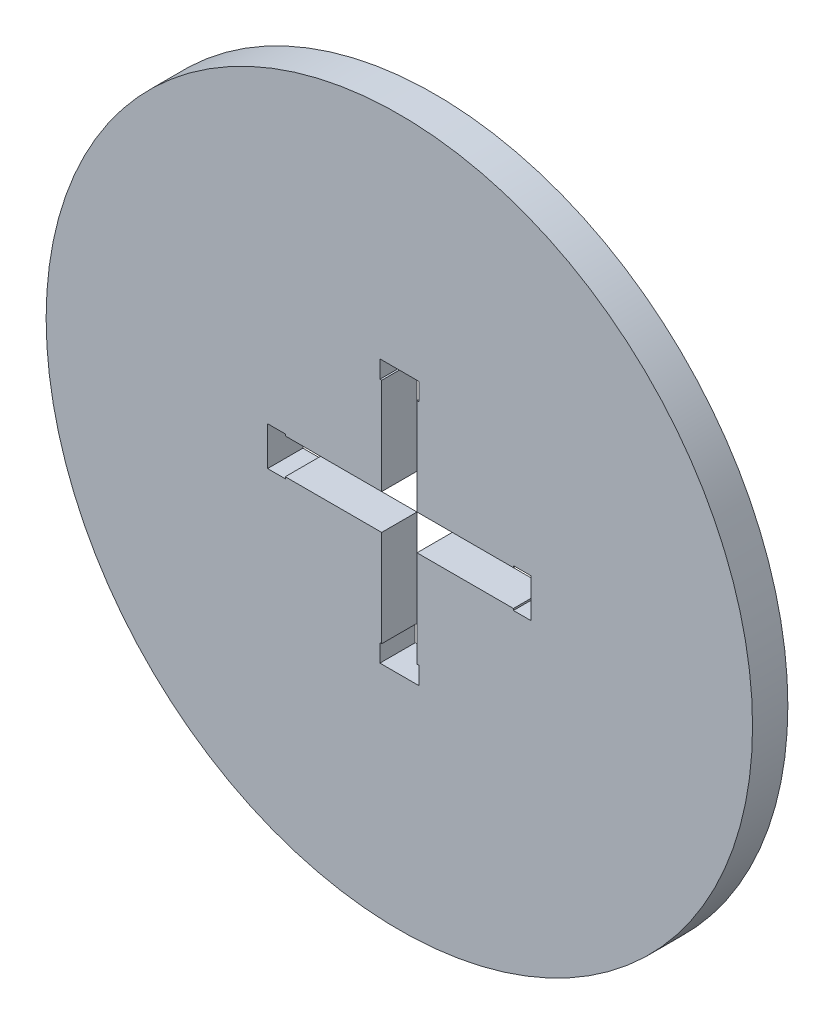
ISO-10303-21;
HEADER;
FILE_DESCRIPTION(('STEP AP214'),'2;1');
FILE_NAME('part.step','',(''),(''),'','','');
FILE_SCHEMA(('AUTOMOTIVE_DESIGN { 1 0 10303 214 1 1 1 1 }'));
ENDSEC;
DATA;
#1=APPLICATION_CONTEXT('core data for automotive mechanical design processes');
#2=APPLICATION_PROTOCOL_DEFINITION('international standard','automotive_design',2000,#1);
#3=PRODUCT_CONTEXT('',#1,'mechanical');
#4=PRODUCT('Part','Part','',(#3));
#5=PRODUCT_RELATED_PRODUCT_CATEGORY('part','',(#4));
#6=PRODUCT_DEFINITION_FORMATION('','',#4);
#7=PRODUCT_DEFINITION_CONTEXT('part definition',#1,'design');
#8=PRODUCT_DEFINITION('design','',#6,#7);
#9=PRODUCT_DEFINITION_SHAPE('','',#8);
#10=(LENGTH_UNIT() NAMED_UNIT(*) SI_UNIT(.MILLI.,.METRE.));
#11=(NAMED_UNIT(*) PLANE_ANGLE_UNIT() SI_UNIT($,.RADIAN.));
#12=(NAMED_UNIT(*) SI_UNIT($,.STERADIAN.) SOLID_ANGLE_UNIT());
#13=UNCERTAINTY_MEASURE_WITH_UNIT(LENGTH_MEASURE(1.E-05),#10,'distance_accuracy_value','');
#14=(GEOMETRIC_REPRESENTATION_CONTEXT(3) GLOBAL_UNCERTAINTY_ASSIGNED_CONTEXT((#13)) GLOBAL_UNIT_ASSIGNED_CONTEXT((#10,
#11,#12)) REPRESENTATION_CONTEXT('',''));
#15=CARTESIAN_POINT('',(0.,0.,0.));
#16=DIRECTION('',(0.,0.,1.));
#17=DIRECTION('',(1.,0.,0.));
#18=AXIS2_PLACEMENT_3D('',#15,#16,#17);
#19=CARTESIAN_POINT('',(0.,0.,12.7));
#20=DIRECTION('',(0.,0.,1.));
#21=DIRECTION('',(1.,0.,0.));
#22=AXIS2_PLACEMENT_3D('',#19,#20,#21);
#23=PLANE('',#22);
#24=DIRECTION('',(0.,-1.,0.));
#25=VECTOR('',#24,1.);
#26=CARTESIAN_POINT('',(47.371,6.35000000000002,12.7));
#27=LINE('',#26,#25);
#28=CARTESIAN_POINT('',(47.371,6.98499999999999,12.7));
#29=VERTEX_POINT('',#28);
#30=CARTESIAN_POINT('',(47.371,-6.98500000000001,12.7));
#31=VERTEX_POINT('',#30);
#32=EDGE_CURVE('E414',#29,#31,#27,.T.);
#33=ORIENTED_EDGE('',*,*,#32,.T.);
#34=DIRECTION('',(1.,0.,0.));
#35=VECTOR('',#34,1.);
#36=CARTESIAN_POINT('',(47.371,-6.98500000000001,12.7));
#37=LINE('',#36,#35);
#38=CARTESIAN_POINT('',(41.021,-6.98500000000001,12.7));
#39=VERTEX_POINT('',#38);
#40=EDGE_CURVE('E239',#39,#31,#37,.T.);
#41=ORIENTED_EDGE('',*,*,#40,.F.);
#42=DIRECTION('',(0.,-1.,0.));
#43=VECTOR('',#42,1.);
#44=CARTESIAN_POINT('',(41.021,-6.35000000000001,12.7));
#45=LINE('',#44,#43);
#46=CARTESIAN_POINT('',(41.021,-6.35000000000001,12.7));
#47=VERTEX_POINT('',#46);
#48=EDGE_CURVE('E220',#47,#39,#45,.T.);
#49=ORIENTED_EDGE('',*,*,#48,.F.);
#50=DIRECTION('',(-1.,0.,0.));
#51=VECTOR('',#50,1.);
#52=CARTESIAN_POINT('',(47.371,-6.35000000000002,12.7));
#53=LINE('',#52,#51);
#54=CARTESIAN_POINT('',(6.35000000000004,-6.35000000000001,12.7));
#55=VERTEX_POINT('',#54);
#56=EDGE_CURVE('E412',#47,#55,#53,.T.);
#57=ORIENTED_EDGE('',*,*,#56,.T.);
#58=DIRECTION('',(0.,-1.,0.));
#59=VECTOR('',#58,1.);
#60=CARTESIAN_POINT('',(6.35000000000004,-6.35000000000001,12.7));
#61=LINE('',#60,#59);
#62=CARTESIAN_POINT('',(6.34999999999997,-41.021,12.7));
#63=VERTEX_POINT('',#62);
#64=EDGE_CURVE('E409',#55,#63,#61,.T.);
#65=ORIENTED_EDGE('',*,*,#64,.T.);
#66=DIRECTION('',(1.,0.,0.));
#67=VECTOR('',#66,1.);
#68=CARTESIAN_POINT('',(6.34999999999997,-41.021,12.7));
#69=LINE('',#68,#67);
#70=CARTESIAN_POINT('',(6.98499999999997,-41.021,12.7));
#71=VERTEX_POINT('',#70);
#72=EDGE_CURVE('E270',#63,#71,#69,.T.);
#73=ORIENTED_EDGE('',*,*,#72,.T.);
#74=DIRECTION('',(0.,-1.,0.));
#75=VECTOR('',#74,1.);
#76=CARTESIAN_POINT('',(6.98499999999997,-47.371,12.7));
#77=LINE('',#76,#75);
#78=CARTESIAN_POINT('',(6.98499999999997,-47.371,12.7));
#79=VERTEX_POINT('',#78);
#80=EDGE_CURVE('E273',#71,#79,#77,.T.);
#81=ORIENTED_EDGE('',*,*,#80,.T.);
#82=DIRECTION('',(1.,0.,0.));
#83=VECTOR('',#82,1.);
#84=CARTESIAN_POINT('',(-6.35000000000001,-47.371,12.7));
#85=LINE('',#84,#83);
#86=CARTESIAN_POINT('',(-6.98500000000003,-47.371,12.7));
#87=VERTEX_POINT('',#86);
#88=EDGE_CURVE('E407',#87,#79,#85,.T.);
#89=ORIENTED_EDGE('',*,*,#88,.F.);
#90=DIRECTION('',(0.,1.,0.));
#91=VECTOR('',#90,1.);
#92=CARTESIAN_POINT('',(-6.98500000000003,-47.371,12.7));
#93=LINE('',#92,#91);
#94=CARTESIAN_POINT('',(-6.98500000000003,-41.021,12.7));
#95=VERTEX_POINT('',#94);
#96=EDGE_CURVE('E290',#87,#95,#93,.T.);
#97=ORIENTED_EDGE('',*,*,#96,.T.);
#98=DIRECTION('',(1.,0.,0.));
#99=VECTOR('',#98,1.);
#100=CARTESIAN_POINT('',(-6.35000000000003,-41.021,12.7));
#101=LINE('',#100,#99);
#102=CARTESIAN_POINT('',(-6.35000000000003,-41.021,12.7));
#103=VERTEX_POINT('',#102);
#104=EDGE_CURVE('E245',#95,#103,#101,.T.);
#105=ORIENTED_EDGE('',*,*,#104,.T.);
#106=DIRECTION('',(0.,-1.,0.));
#107=VECTOR('',#106,1.);
#108=CARTESIAN_POINT('',(-6.35000000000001,-6.35000000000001,12.7));
#109=LINE('',#108,#107);
#110=CARTESIAN_POINT('',(-6.35000000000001,-6.35000000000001,12.7));
#111=VERTEX_POINT('',#110);
#112=EDGE_CURVE('E319',#111,#103,#109,.T.);
#113=ORIENTED_EDGE('',*,*,#112,.F.);
#114=DIRECTION('',(1.,0.,0.));
#115=VECTOR('',#114,1.);
#116=CARTESIAN_POINT('',(-47.371,-6.34999999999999,12.7));
#117=LINE('',#116,#115);
#118=CARTESIAN_POINT('',(-41.021,-6.34999999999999,12.7));
#119=VERTEX_POINT('',#118);
#120=EDGE_CURVE('E380',#119,#111,#117,.T.);
#121=ORIENTED_EDGE('',*,*,#120,.F.);
#122=DIRECTION('',(0.,1.,0.));
#123=VECTOR('',#122,1.);
#124=CARTESIAN_POINT('',(-41.021,-6.34999999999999,12.7));
#125=LINE('',#124,#123);
#126=CARTESIAN_POINT('',(-41.021,-6.98499999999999,12.7));
#127=VERTEX_POINT('',#126);
#128=EDGE_CURVE('E363',#127,#119,#125,.T.);
#129=ORIENTED_EDGE('',*,*,#128,.F.);
#130=DIRECTION('',(1.,0.,0.));
#131=VECTOR('',#130,1.);
#132=CARTESIAN_POINT('',(-47.371,-6.98499999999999,12.7));
#133=LINE('',#132,#131);
#134=CARTESIAN_POINT('',(-47.371,-6.98499999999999,12.7));
#135=VERTEX_POINT('',#134);
#136=EDGE_CURVE('E282',#135,#127,#133,.T.);
#137=ORIENTED_EDGE('',*,*,#136,.F.);
#138=DIRECTION('',(0.,-1.,0.));
#139=VECTOR('',#138,1.);
#140=CARTESIAN_POINT('',(-47.371,6.35000000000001,12.7));
#141=LINE('',#140,#139);
#142=CARTESIAN_POINT('',(-47.371,6.98500000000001,12.7));
#143=VERTEX_POINT('',#142);
#144=EDGE_CURVE('E428',#143,#135,#141,.T.);
#145=ORIENTED_EDGE('',*,*,#144,.F.);
#146=DIRECTION('',(-1.,0.,0.));
#147=VECTOR('',#146,1.);
#148=CARTESIAN_POINT('',(-47.371,6.98500000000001,12.7));
#149=LINE('',#148,#147);
#150=CARTESIAN_POINT('',(-41.021,6.98500000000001,12.7));
#151=VERTEX_POINT('',#150);
#152=EDGE_CURVE('E344',#151,#143,#149,.T.);
#153=ORIENTED_EDGE('',*,*,#152,.F.);
#154=DIRECTION('',(0.,1.,0.));
#155=VECTOR('',#154,1.);
#156=CARTESIAN_POINT('',(-41.021,6.35000000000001,12.7));
#157=LINE('',#156,#155);
#158=CARTESIAN_POINT('',(-41.021,6.35000000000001,12.7));
#159=VERTEX_POINT('',#158);
#160=EDGE_CURVE('E348',#159,#151,#157,.T.);
#161=ORIENTED_EDGE('',*,*,#160,.F.);
#162=DIRECTION('',(-1.,0.,0.));
#163=VECTOR('',#162,1.);
#164=CARTESIAN_POINT('',(-6.35000000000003,6.35,12.7));
#165=LINE('',#164,#163);
#166=CARTESIAN_POINT('',(-6.35000000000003,6.35,12.7));
#167=VERTEX_POINT('',#166);
#168=EDGE_CURVE('E425',#167,#159,#165,.T.);
#169=ORIENTED_EDGE('',*,*,#168,.F.);
#170=DIRECTION('',(0.,-1.,0.));
#171=VECTOR('',#170,1.);
#172=CARTESIAN_POINT('',(-6.35000000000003,47.371,12.7));
#173=LINE('',#172,#171);
#174=CARTESIAN_POINT('',(-6.35000000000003,41.021,12.7));
#175=VERTEX_POINT('',#174);
#176=EDGE_CURVE('E423',#175,#167,#173,.T.);
#177=ORIENTED_EDGE('',*,*,#176,.F.);
#178=DIRECTION('',(1.,0.,0.));
#179=VECTOR('',#178,1.);
#180=CARTESIAN_POINT('',(-6.35000000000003,41.021,12.7));
#181=LINE('',#180,#179);
#182=CARTESIAN_POINT('',(-6.98500000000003,41.021,12.7));
#183=VERTEX_POINT('',#182);
#184=EDGE_CURVE('E327',#183,#175,#181,.T.);
#185=ORIENTED_EDGE('',*,*,#184,.F.);
#186=DIRECTION('',(0.,-1.,0.));
#187=VECTOR('',#186,1.);
#188=CARTESIAN_POINT('',(-6.98500000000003,47.371,12.7));
#189=LINE('',#188,#187);
#190=CARTESIAN_POINT('',(-6.98500000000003,47.371,12.7));
#191=VERTEX_POINT('',#190);
#192=EDGE_CURVE('E331',#191,#183,#189,.T.);
#193=ORIENTED_EDGE('',*,*,#192,.F.);
#194=DIRECTION('',(-1.,0.,0.));
#195=VECTOR('',#194,1.);
#196=CARTESIAN_POINT('',(6.34999999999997,47.371,12.7));
#197=LINE('',#196,#195);
#198=CARTESIAN_POINT('',(6.98499999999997,47.371,12.7));
#199=VERTEX_POINT('',#198);
#200=EDGE_CURVE('E421',#199,#191,#197,.T.);
#201=ORIENTED_EDGE('',*,*,#200,.F.);
#202=DIRECTION('',(0.,1.,0.));
#203=VECTOR('',#202,1.);
#204=CARTESIAN_POINT('',(6.98499999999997,47.371,12.7));
#205=LINE('',#204,#203);
#206=CARTESIAN_POINT('',(6.98499999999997,41.021,12.7));
#207=VERTEX_POINT('',#206);
#208=EDGE_CURVE('E306',#207,#199,#205,.T.);
#209=ORIENTED_EDGE('',*,*,#208,.F.);
#210=DIRECTION('',(1.,0.,0.));
#211=VECTOR('',#210,1.);
#212=CARTESIAN_POINT('',(6.34999999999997,41.021,12.7));
#213=LINE('',#212,#211);
#214=CARTESIAN_POINT('',(6.34999999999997,41.021,12.7));
#215=VERTEX_POINT('',#214);
#216=EDGE_CURVE('E310',#215,#207,#213,.T.);
#217=ORIENTED_EDGE('',*,*,#216,.F.);
#218=DIRECTION('',(0.,-1.,0.));
#219=VECTOR('',#218,1.);
#220=CARTESIAN_POINT('',(6.34999999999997,47.371,12.7));
#221=LINE('',#220,#219);
#222=CARTESIAN_POINT('',(6.35000000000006,6.35,12.7));
#223=VERTEX_POINT('',#222);
#224=EDGE_CURVE('E419',#215,#223,#221,.T.);
#225=ORIENTED_EDGE('',*,*,#224,.T.);
#226=DIRECTION('',(1.,0.,0.));
#227=VECTOR('',#226,1.);
#228=CARTESIAN_POINT('',(6.35000000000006,6.35,12.7));
#229=LINE('',#228,#227);
#230=CARTESIAN_POINT('',(41.021,6.34999999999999,12.7));
#231=VERTEX_POINT('',#230);
#232=EDGE_CURVE('E416',#223,#231,#229,.T.);
#233=ORIENTED_EDGE('',*,*,#232,.T.);
#234=DIRECTION('',(0.,-1.,0.));
#235=VECTOR('',#234,1.);
#236=CARTESIAN_POINT('',(41.021,6.34999999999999,12.7));
#237=LINE('',#236,#235);
#238=CARTESIAN_POINT('',(41.021,6.98499999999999,12.7));
#239=VERTEX_POINT('',#238);
#240=EDGE_CURVE('E252',#239,#231,#237,.T.);
#241=ORIENTED_EDGE('',*,*,#240,.F.);
#242=DIRECTION('',(-1.,0.,0.));
#243=VECTOR('',#242,1.);
#244=CARTESIAN_POINT('',(47.371,6.98499999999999,12.7));
#245=LINE('',#244,#243);
#246=EDGE_CURVE('E256',#29,#239,#245,.T.);
#247=ORIENTED_EDGE('',*,*,#246,.F.);
#248=EDGE_LOOP('',(#33,#41,#49,#57,#65,#73,#81,#89,#97,#105,#113,#121,#129,#137,#145,#153,#161,
#169,#177,#185,#193,#201,#209,#217,#225,#233,#241,#247));
#249=FACE_BOUND('',#248,.T.);
#250=CARTESIAN_POINT('',(0.,0.,12.7));
#251=DIRECTION('',(0.,0.,1.));
#252=DIRECTION('',(1.,0.,0.));
#253=AXIS2_PLACEMENT_3D('',#250,#251,#252);
#254=CIRCLE('',#253,127.);
#255=CARTESIAN_POINT('',(127.,0.,12.7));
#256=VERTEX_POINT('',#255);
#257=EDGE_CURVE('E11',#256,#256,#254,.T.);
#258=ORIENTED_EDGE('',*,*,#257,.T.);
#259=EDGE_LOOP('',(#258));
#260=FACE_BOUND('',#259,.T.);
#261=ADVANCED_FACE('F33',(#249,#260),#23,.T.);
#262=CARTESIAN_POINT('',(0.,0.,0.));
#263=DIRECTION('',(0.,0.,1.));
#264=DIRECTION('',(1.,0.,0.));
#265=AXIS2_PLACEMENT_3D('',#262,#263,#264);
#266=PLANE('',#265);
#267=DIRECTION('',(1.,0.,0.));
#268=VECTOR('',#267,1.);
#269=CARTESIAN_POINT('',(47.371,-6.98500000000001,0.));
#270=LINE('',#269,#268);
#271=CARTESIAN_POINT('',(41.021,-6.98500000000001,0.));
#272=VERTEX_POINT('',#271);
#273=CARTESIAN_POINT('',(47.371,-6.98500000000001,0.));
#274=VERTEX_POINT('',#273);
#275=EDGE_CURVE('E229',#272,#274,#270,.T.);
#276=ORIENTED_EDGE('',*,*,#275,.T.);
#277=DIRECTION('',(0.,-1.,0.));
#278=VECTOR('',#277,1.);
#279=CARTESIAN_POINT('',(47.371,6.35000000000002,0.));
#280=LINE('',#279,#278);
#281=CARTESIAN_POINT('',(47.371,6.98499999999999,0.));
#282=VERTEX_POINT('',#281);
#283=EDGE_CURVE('E386',#282,#274,#280,.T.);
#284=ORIENTED_EDGE('',*,*,#283,.F.);
#285=DIRECTION('',(-1.,0.,0.));
#286=VECTOR('',#285,1.);
#287=CARTESIAN_POINT('',(47.371,6.98499999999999,0.));
#288=LINE('',#287,#286);
#289=CARTESIAN_POINT('',(41.021,6.98499999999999,0.));
#290=VERTEX_POINT('',#289);
#291=EDGE_CURVE('E248',#282,#290,#288,.T.);
#292=ORIENTED_EDGE('',*,*,#291,.T.);
#293=DIRECTION('',(0.,-1.,0.));
#294=VECTOR('',#293,1.);
#295=CARTESIAN_POINT('',(41.021,6.34999999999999,0.));
#296=LINE('',#295,#294);
#297=CARTESIAN_POINT('',(41.021,6.34999999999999,0.));
#298=VERTEX_POINT('',#297);
#299=EDGE_CURVE('E251',#290,#298,#296,.T.);
#300=ORIENTED_EDGE('',*,*,#299,.T.);
#301=DIRECTION('',(1.,0.,0.));
#302=VECTOR('',#301,1.);
#303=CARTESIAN_POINT('',(6.35000000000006,6.35,0.));
#304=LINE('',#303,#302);
#305=CARTESIAN_POINT('',(6.35000000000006,6.35,0.));
#306=VERTEX_POINT('',#305);
#307=EDGE_CURVE('E388',#306,#298,#304,.T.);
#308=ORIENTED_EDGE('',*,*,#307,.F.);
#309=DIRECTION('',(0.,-1.,0.));
#310=VECTOR('',#309,1.);
#311=CARTESIAN_POINT('',(6.34999999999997,47.371,0.));
#312=LINE('',#311,#310);
#313=CARTESIAN_POINT('',(6.34999999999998,41.021,0.));
#314=VERTEX_POINT('',#313);
#315=EDGE_CURVE('E391',#314,#306,#312,.T.);
#316=ORIENTED_EDGE('',*,*,#315,.F.);
#317=DIRECTION('',(1.,0.,0.));
#318=VECTOR('',#317,1.);
#319=CARTESIAN_POINT('',(6.34999999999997,41.021,0.));
#320=LINE('',#319,#318);
#321=CARTESIAN_POINT('',(6.98499999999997,41.021,0.));
#322=VERTEX_POINT('',#321);
#323=EDGE_CURVE('E302',#314,#322,#320,.T.);
#324=ORIENTED_EDGE('',*,*,#323,.T.);
#325=DIRECTION('',(0.,1.,0.));
#326=VECTOR('',#325,1.);
#327=CARTESIAN_POINT('',(6.98499999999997,47.371,0.));
#328=LINE('',#327,#326);
#329=CARTESIAN_POINT('',(6.98499999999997,47.371,0.));
#330=VERTEX_POINT('',#329);
#331=EDGE_CURVE('E305',#322,#330,#328,.T.);
#332=ORIENTED_EDGE('',*,*,#331,.T.);
#333=DIRECTION('',(-1.,0.,0.));
#334=VECTOR('',#333,1.);
#335=CARTESIAN_POINT('',(6.34999999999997,47.371,0.));
#336=LINE('',#335,#334);
#337=CARTESIAN_POINT('',(-6.98500000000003,47.371,0.));
#338=VERTEX_POINT('',#337);
#339=EDGE_CURVE('E393',#330,#338,#336,.T.);
#340=ORIENTED_EDGE('',*,*,#339,.T.);
#341=DIRECTION('',(0.,-1.,0.));
#342=VECTOR('',#341,1.);
#343=CARTESIAN_POINT('',(-6.98500000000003,47.371,0.));
#344=LINE('',#343,#342);
#345=CARTESIAN_POINT('',(-6.98500000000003,41.021,0.));
#346=VERTEX_POINT('',#345);
#347=EDGE_CURVE('E323',#338,#346,#344,.T.);
#348=ORIENTED_EDGE('',*,*,#347,.T.);
#349=DIRECTION('',(1.,0.,0.));
#350=VECTOR('',#349,1.);
#351=CARTESIAN_POINT('',(-6.35000000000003,41.021,0.));
#352=LINE('',#351,#350);
#353=CARTESIAN_POINT('',(-6.35000000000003,41.021,0.));
#354=VERTEX_POINT('',#353);
#355=EDGE_CURVE('E326',#346,#354,#352,.T.);
#356=ORIENTED_EDGE('',*,*,#355,.T.);
#357=DIRECTION('',(0.,-1.,0.));
#358=VECTOR('',#357,1.);
#359=CARTESIAN_POINT('',(-6.35000000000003,47.371,0.));
#360=LINE('',#359,#358);
#361=CARTESIAN_POINT('',(-6.35000000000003,6.35,0.));
#362=VERTEX_POINT('',#361);
#363=EDGE_CURVE('E395',#354,#362,#360,.T.);
#364=ORIENTED_EDGE('',*,*,#363,.T.);
#365=DIRECTION('',(-1.,0.,0.));
#366=VECTOR('',#365,1.);
#367=CARTESIAN_POINT('',(-6.35000000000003,6.35,0.));
#368=LINE('',#367,#366);
#369=CARTESIAN_POINT('',(-41.021,6.35000000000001,0.));
#370=VERTEX_POINT('',#369);
#371=EDGE_CURVE('E397',#362,#370,#368,.T.);
#372=ORIENTED_EDGE('',*,*,#371,.T.);
#373=DIRECTION('',(0.,1.,0.));
#374=VECTOR('',#373,1.);
#375=CARTESIAN_POINT('',(-41.021,6.35000000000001,0.));
#376=LINE('',#375,#374);
#377=CARTESIAN_POINT('',(-41.021,6.98500000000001,0.));
#378=VERTEX_POINT('',#377);
#379=EDGE_CURVE('E56',#370,#378,#376,.T.);
#380=ORIENTED_EDGE('',*,*,#379,.T.);
#381=DIRECTION('',(-1.,0.,0.));
#382=VECTOR('',#381,1.);
#383=CARTESIAN_POINT('',(-47.371,6.98500000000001,0.));
#384=LINE('',#383,#382);
#385=CARTESIAN_POINT('',(-47.371,6.98500000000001,0.));
#386=VERTEX_POINT('',#385);
#387=EDGE_CURVE('E343',#378,#386,#384,.T.);
#388=ORIENTED_EDGE('',*,*,#387,.T.);
#389=DIRECTION('',(0.,-1.,0.));
#390=VECTOR('',#389,1.);
#391=CARTESIAN_POINT('',(-47.371,6.35000000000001,0.));
#392=LINE('',#391,#390);
#393=CARTESIAN_POINT('',(-47.371,-6.98499999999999,0.));
#394=VERTEX_POINT('',#393);
#395=EDGE_CURVE('E400',#386,#394,#392,.T.);
#396=ORIENTED_EDGE('',*,*,#395,.T.);
#397=DIRECTION('',(1.,0.,0.));
#398=VECTOR('',#397,1.);
#399=CARTESIAN_POINT('',(-47.371,-6.98499999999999,0.));
#400=LINE('',#399,#398);
#401=CARTESIAN_POINT('',(-41.021,-6.98499999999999,0.));
#402=VERTEX_POINT('',#401);
#403=EDGE_CURVE('E359',#394,#402,#400,.T.);
#404=ORIENTED_EDGE('',*,*,#403,.T.);
#405=DIRECTION('',(0.,1.,0.));
#406=VECTOR('',#405,1.);
#407=CARTESIAN_POINT('',(-41.021,-6.34999999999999,0.));
#408=LINE('',#407,#406);
#409=CARTESIAN_POINT('',(-41.021,-6.34999999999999,0.));
#410=VERTEX_POINT('',#409);
#411=EDGE_CURVE('E362',#402,#410,#408,.T.);
#412=ORIENTED_EDGE('',*,*,#411,.T.);
#413=DIRECTION('',(1.,0.,0.));
#414=VECTOR('',#413,1.);
#415=CARTESIAN_POINT('',(-47.371,-6.34999999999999,0.));
#416=LINE('',#415,#414);
#417=CARTESIAN_POINT('',(-6.35000000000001,-6.35000000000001,0.));
#418=VERTEX_POINT('',#417);
#419=EDGE_CURVE('E402',#410,#418,#416,.T.);
#420=ORIENTED_EDGE('',*,*,#419,.T.);
#421=DIRECTION('',(0.,-1.,0.));
#422=VECTOR('',#421,1.);
#423=CARTESIAN_POINT('',(-6.35000000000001,-6.35000000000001,0.));
#424=LINE('',#423,#422);
#425=CARTESIAN_POINT('',(-6.35000000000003,-41.021,0.));
#426=VERTEX_POINT('',#425);
#427=EDGE_CURVE('E376',#418,#426,#424,.T.);
#428=ORIENTED_EDGE('',*,*,#427,.T.);
#429=DIRECTION('',(1.,0.,0.));
#430=VECTOR('',#429,1.);
#431=CARTESIAN_POINT('',(-6.35000000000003,-41.021,0.));
#432=LINE('',#431,#430);
#433=CARTESIAN_POINT('',(-6.98500000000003,-41.021,0.));
#434=VERTEX_POINT('',#433);
#435=EDGE_CURVE('E287',#434,#426,#432,.T.);
#436=ORIENTED_EDGE('',*,*,#435,.F.);
#437=DIRECTION('',(0.,1.,0.));
#438=VECTOR('',#437,1.);
#439=CARTESIAN_POINT('',(-6.98500000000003,-47.371,0.));
#440=LINE('',#439,#438);
#441=CARTESIAN_POINT('',(-6.98500000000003,-47.371,0.));
#442=VERTEX_POINT('',#441);
#443=EDGE_CURVE('E289',#442,#434,#440,.T.);
#444=ORIENTED_EDGE('',*,*,#443,.F.);
#445=DIRECTION('',(1.,0.,0.));
#446=VECTOR('',#445,1.);
#447=CARTESIAN_POINT('',(-6.35000000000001,-47.371,0.));
#448=LINE('',#447,#446);
#449=CARTESIAN_POINT('',(6.98499999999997,-47.371,0.));
#450=VERTEX_POINT('',#449);
#451=EDGE_CURVE('E379',#442,#450,#448,.T.);
#452=ORIENTED_EDGE('',*,*,#451,.T.);
#453=DIRECTION('',(0.,-1.,0.));
#454=VECTOR('',#453,1.);
#455=CARTESIAN_POINT('',(6.98499999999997,-47.371,0.));
#456=LINE('',#455,#454);
#457=CARTESIAN_POINT('',(6.98499999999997,-41.021,0.));
#458=VERTEX_POINT('',#457);
#459=EDGE_CURVE('E266',#458,#450,#456,.T.);
#460=ORIENTED_EDGE('',*,*,#459,.F.);
#461=DIRECTION('',(1.,0.,0.));
#462=VECTOR('',#461,1.);
#463=CARTESIAN_POINT('',(6.34999999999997,-41.021,0.));
#464=LINE('',#463,#462);
#465=CARTESIAN_POINT('',(6.34999999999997,-41.021,0.));
#466=VERTEX_POINT('',#465);
#467=EDGE_CURVE('E269',#466,#458,#464,.T.);
#468=ORIENTED_EDGE('',*,*,#467,.F.);
#469=DIRECTION('',(0.,-1.,0.));
#470=VECTOR('',#469,1.);
#471=CARTESIAN_POINT('',(6.35000000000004,-6.35000000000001,0.));
#472=LINE('',#471,#470);
#473=CARTESIAN_POINT('',(6.35000000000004,-6.35000000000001,0.));
#474=VERTEX_POINT('',#473);
#475=EDGE_CURVE('E382',#474,#466,#472,.T.);
#476=ORIENTED_EDGE('',*,*,#475,.F.);
#477=DIRECTION('',(-1.,0.,0.));
#478=VECTOR('',#477,1.);
#479=CARTESIAN_POINT('',(47.371,-6.35000000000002,0.));
#480=LINE('',#479,#478);
#481=CARTESIAN_POINT('',(41.021,-6.35000000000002,0.));
#482=VERTEX_POINT('',#481);
#483=EDGE_CURVE('E238',#482,#474,#480,.T.);
#484=ORIENTED_EDGE('',*,*,#483,.F.);
#485=DIRECTION('',(0.,-1.,0.));
#486=VECTOR('',#485,1.);
#487=CARTESIAN_POINT('',(41.021,-6.35000000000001,0.));
#488=LINE('',#487,#486);
#489=EDGE_CURVE('E48',#482,#272,#488,.T.);
#490=ORIENTED_EDGE('',*,*,#489,.T.);
#491=EDGE_LOOP('',(#276,#284,#292,#300,#308,#316,#324,#332,#340,#348,#356,#364,#372,#380,#388,
#396,#404,#412,#420,#428,#436,#444,#452,#460,#468,#476,#484,#490));
#492=FACE_BOUND('',#491,.T.);
#493=CARTESIAN_POINT('',(0.,0.,0.));
#494=DIRECTION('',(0.,0.,1.));
#495=DIRECTION('',(1.,0.,0.));
#496=AXIS2_PLACEMENT_3D('',#493,#494,#495);
#497=CIRCLE('',#496,127.);
#498=CARTESIAN_POINT('',(127.,0.,0.));
#499=VERTEX_POINT('',#498);
#500=EDGE_CURVE('E37',#499,#499,#497,.T.);
#501=ORIENTED_EDGE('',*,*,#500,.F.);
#502=EDGE_LOOP('',(#501));
#503=FACE_BOUND('',#502,.T.);
#504=ADVANCED_FACE('F235',(#492,#503),#266,.F.);
#505=CARTESIAN_POINT('',(-6.35000000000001,-6.35000000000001,0.));
#506=DIRECTION('',(-1.,0.,0.));
#507=DIRECTION('',(0.,-1.,0.));
#508=AXIS2_PLACEMENT_3D('',#505,#506,#507);
#509=PLANE('',#508);
#510=DIRECTION('',(0.,0.,1.));
#511=VECTOR('',#510,1.);
#512=CARTESIAN_POINT('',(-6.35000000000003,-41.021,0.));
#513=LINE('',#512,#511);
#514=EDGE_CURVE('E292',#426,#103,#513,.T.);
#515=ORIENTED_EDGE('',*,*,#514,.F.);
#516=ORIENTED_EDGE('',*,*,#427,.F.);
#517=DIRECTION('',(0.,0.,1.));
#518=VECTOR('',#517,1.);
#519=CARTESIAN_POINT('',(-6.35000000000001,-6.35000000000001,0.));
#520=LINE('',#519,#518);
#521=EDGE_CURVE('E431',#418,#111,#520,.T.);
#522=ORIENTED_EDGE('',*,*,#521,.T.);
#523=ORIENTED_EDGE('',*,*,#112,.T.);
#524=EDGE_LOOP('',(#515,#516,#522,#523));
#525=FACE_BOUND('',#524,.T.);
#526=ADVANCED_FACE('F523',(#525),#509,.F.);
#527=CARTESIAN_POINT('',(6.35000000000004,-6.35000000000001,0.));
#528=DIRECTION('',(-1.,0.,0.));
#529=DIRECTION('',(0.,-1.,0.));
#530=AXIS2_PLACEMENT_3D('',#527,#528,#529);
#531=PLANE('',#530);
#532=ORIENTED_EDGE('',*,*,#475,.T.);
#533=DIRECTION('',(0.,0.,1.));
#534=VECTOR('',#533,1.);
#535=CARTESIAN_POINT('',(6.34999999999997,-41.021,0.));
#536=LINE('',#535,#534);
#537=EDGE_CURVE('E279',#466,#63,#536,.T.);
#538=ORIENTED_EDGE('',*,*,#537,.T.);
#539=ORIENTED_EDGE('',*,*,#64,.F.);
#540=DIRECTION('',(0.,0.,1.));
#541=VECTOR('',#540,1.);
#542=CARTESIAN_POINT('',(6.35000000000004,-6.35000000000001,0.));
#543=LINE('',#542,#541);
#544=EDGE_CURVE('E404',#474,#55,#543,.T.);
#545=ORIENTED_EDGE('',*,*,#544,.F.);
#546=EDGE_LOOP('',(#532,#538,#539,#545));
#547=FACE_BOUND('',#546,.T.);
#548=ADVANCED_FACE('F447',(#547),#531,.T.);
#549=CARTESIAN_POINT('',(0.,0.,12.7));
#550=DIRECTION('',(0.,0.,-1.));
#551=DIRECTION('',(-1.,0.,0.));
#552=AXIS2_PLACEMENT_3D('',#549,#550,#551);
#553=CYLINDRICAL_SURFACE('',#552,127.);
#554=ORIENTED_EDGE('',*,*,#257,.F.);
#555=EDGE_LOOP('',(#554));
#556=FACE_BOUND('',#555,.T.);
#557=ORIENTED_EDGE('',*,*,#500,.T.);
#558=EDGE_LOOP('',(#557));
#559=FACE_BOUND('',#558,.T.);
#560=ADVANCED_FACE('F35',(#556,#559),#553,.T.);
#561=CARTESIAN_POINT('',(-47.371,-6.34999999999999,0.));
#562=DIRECTION('',(0.,-1.,0.));
#563=DIRECTION('',(1.,0.,0.));
#564=AXIS2_PLACEMENT_3D('',#561,#562,#563);
#565=PLANE('',#564);
#566=ORIENTED_EDGE('',*,*,#419,.F.);
#567=DIRECTION('',(0.,0.,1.));
#568=VECTOR('',#567,1.);
#569=CARTESIAN_POINT('',(-41.021,-6.34999999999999,0.));
#570=LINE('',#569,#568);
#571=EDGE_CURVE('E351',#410,#119,#570,.T.);
#572=ORIENTED_EDGE('',*,*,#571,.T.);
#573=ORIENTED_EDGE('',*,*,#120,.T.);
#574=ORIENTED_EDGE('',*,*,#521,.F.);
#575=EDGE_LOOP('',(#566,#572,#573,#574));
#576=FACE_BOUND('',#575,.T.);
#577=ADVANCED_FACE('F517',(#576),#565,.F.);
#578=CARTESIAN_POINT('',(-47.371,6.35000000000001,0.));
#579=DIRECTION('',(-1.,0.,0.));
#580=DIRECTION('',(0.,-1.,0.));
#581=AXIS2_PLACEMENT_3D('',#578,#579,#580);
#582=PLANE('',#581);
#583=ORIENTED_EDGE('',*,*,#144,.T.);
#584=DIRECTION('',(0.,0.,1.));
#585=VECTOR('',#584,1.);
#586=CARTESIAN_POINT('',(-47.371,-6.98499999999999,0.));
#587=LINE('',#586,#585);
#588=EDGE_CURVE('E366',#394,#135,#587,.T.);
#589=ORIENTED_EDGE('',*,*,#588,.F.);
#590=ORIENTED_EDGE('',*,*,#395,.F.);
#591=DIRECTION('',(0.,0.,1.));
#592=VECTOR('',#591,1.);
#593=CARTESIAN_POINT('',(-47.371,6.98500000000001,0.));
#594=LINE('',#593,#592);
#595=EDGE_CURVE('E334',#386,#143,#594,.T.);
#596=ORIENTED_EDGE('',*,*,#595,.T.);
#597=EDGE_LOOP('',(#583,#589,#590,#596));
#598=FACE_BOUND('',#597,.T.);
#599=ADVANCED_FACE('F507',(#598),#582,.F.);
#600=CARTESIAN_POINT('',(-6.35000000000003,6.35,0.));
#601=DIRECTION('',(0.,1.,0.));
#602=DIRECTION('',(-1.,0.,0.));
#603=AXIS2_PLACEMENT_3D('',#600,#601,#602);
#604=PLANE('',#603);
#605=ORIENTED_EDGE('',*,*,#168,.T.);
#606=DIRECTION('',(0.,0.,1.));
#607=VECTOR('',#606,1.);
#608=CARTESIAN_POINT('',(-41.021,6.35000000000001,0.));
#609=LINE('',#608,#607);
#610=EDGE_CURVE('E347',#370,#159,#609,.T.);
#611=ORIENTED_EDGE('',*,*,#610,.F.);
#612=ORIENTED_EDGE('',*,*,#371,.F.);
#613=DIRECTION('',(0.,0.,1.));
#614=VECTOR('',#613,1.);
#615=CARTESIAN_POINT('',(-6.35000000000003,6.35,0.));
#616=LINE('',#615,#614);
#617=EDGE_CURVE('E434',#362,#167,#616,.T.);
#618=ORIENTED_EDGE('',*,*,#617,.T.);
#619=EDGE_LOOP('',(#605,#611,#612,#618));
#620=FACE_BOUND('',#619,.T.);
#621=ADVANCED_FACE('F499',(#620),#604,.F.);
#622=CARTESIAN_POINT('',(-6.35000000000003,47.371,0.));
#623=DIRECTION('',(-1.,0.,0.));
#624=DIRECTION('',(0.,0.,1.));
#625=AXIS2_PLACEMENT_3D('',#622,#623,#624);
#626=PLANE('',#625);
#627=ORIENTED_EDGE('',*,*,#363,.F.);
#628=DIRECTION('',(0.,0.,1.));
#629=VECTOR('',#628,1.);
#630=CARTESIAN_POINT('',(-6.35000000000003,41.021,0.));
#631=LINE('',#630,#629);
#632=EDGE_CURVE('E313',#354,#175,#631,.T.);
#633=ORIENTED_EDGE('',*,*,#632,.T.);
#634=ORIENTED_EDGE('',*,*,#176,.T.);
#635=ORIENTED_EDGE('',*,*,#617,.F.);
#636=EDGE_LOOP('',(#627,#633,#634,#635));
#637=FACE_BOUND('',#636,.T.);
#638=ADVANCED_FACE('F493',(#637),#626,.F.);
#639=CARTESIAN_POINT('',(6.34999999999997,47.371,0.));
#640=DIRECTION('',(0.,1.,0.));
#641=DIRECTION('',(0.,0.,1.));
#642=AXIS2_PLACEMENT_3D('',#639,#640,#641);
#643=PLANE('',#642);
#644=ORIENTED_EDGE('',*,*,#200,.T.);
#645=DIRECTION('',(0.,0.,1.));
#646=VECTOR('',#645,1.);
#647=CARTESIAN_POINT('',(-6.98500000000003,47.371,0.));
#648=LINE('',#647,#646);
#649=EDGE_CURVE('E330',#338,#191,#648,.T.);
#650=ORIENTED_EDGE('',*,*,#649,.F.);
#651=ORIENTED_EDGE('',*,*,#339,.F.);
#652=DIRECTION('',(0.,0.,1.));
#653=VECTOR('',#652,1.);
#654=CARTESIAN_POINT('',(6.98499999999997,47.371,0.));
#655=LINE('',#654,#653);
#656=EDGE_CURVE('E316',#330,#199,#655,.T.);
#657=ORIENTED_EDGE('',*,*,#656,.T.);
#658=EDGE_LOOP('',(#644,#650,#651,#657));
#659=FACE_BOUND('',#658,.T.);
#660=ADVANCED_FACE('F480',(#659),#643,.F.);
#661=CARTESIAN_POINT('',(6.34999999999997,47.371,0.));
#662=DIRECTION('',(-1.,0.,0.));
#663=DIRECTION('',(0.,-1.,0.));
#664=AXIS2_PLACEMENT_3D('',#661,#662,#663);
#665=PLANE('',#664);
#666=DIRECTION('',(0.,0.,1.));
#667=VECTOR('',#666,1.);
#668=CARTESIAN_POINT('',(6.34999999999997,41.021,0.));
#669=LINE('',#668,#667);
#670=EDGE_CURVE('E309',#314,#215,#669,.T.);
#671=ORIENTED_EDGE('',*,*,#670,.F.);
#672=ORIENTED_EDGE('',*,*,#315,.T.);
#673=DIRECTION('',(0.,0.,1.));
#674=VECTOR('',#673,1.);
#675=CARTESIAN_POINT('',(6.35000000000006,6.35,0.));
#676=LINE('',#675,#674);
#677=EDGE_CURVE('E437',#306,#223,#676,.T.);
#678=ORIENTED_EDGE('',*,*,#677,.T.);
#679=ORIENTED_EDGE('',*,*,#224,.F.);
#680=EDGE_LOOP('',(#671,#672,#678,#679));
#681=FACE_BOUND('',#680,.T.);
#682=ADVANCED_FACE('F471',(#681),#665,.T.);
#683=CARTESIAN_POINT('',(6.35000000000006,6.35,0.));
#684=DIRECTION('',(0.,-1.,0.));
#685=DIRECTION('',(1.,0.,0.));
#686=AXIS2_PLACEMENT_3D('',#683,#684,#685);
#687=PLANE('',#686);
#688=DIRECTION('',(0.,0.,1.));
#689=VECTOR('',#688,1.);
#690=CARTESIAN_POINT('',(41.021,6.34999999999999,0.));
#691=LINE('',#690,#689);
#692=EDGE_CURVE('E243',#298,#231,#691,.T.);
#693=ORIENTED_EDGE('',*,*,#692,.T.);
#694=ORIENTED_EDGE('',*,*,#232,.F.);
#695=ORIENTED_EDGE('',*,*,#677,.F.);
#696=ORIENTED_EDGE('',*,*,#307,.T.);
#697=EDGE_LOOP('',(#693,#694,#695,#696));
#698=FACE_BOUND('',#697,.T.);
#699=ADVANCED_FACE('F464',(#698),#687,.T.);
#700=CARTESIAN_POINT('',(47.371,6.35000000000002,0.));
#701=DIRECTION('',(-1.,0.,0.));
#702=DIRECTION('',(0.,0.,1.));
#703=AXIS2_PLACEMENT_3D('',#700,#701,#702);
#704=PLANE('',#703);
#705=DIRECTION('',(0.,0.,1.));
#706=VECTOR('',#705,1.);
#707=CARTESIAN_POINT('',(47.371,-6.98500000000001,0.));
#708=LINE('',#707,#706);
#709=EDGE_CURVE('E224',#274,#31,#708,.T.);
#710=ORIENTED_EDGE('',*,*,#709,.T.);
#711=ORIENTED_EDGE('',*,*,#32,.F.);
#712=DIRECTION('',(0.,0.,1.));
#713=VECTOR('',#712,1.);
#714=CARTESIAN_POINT('',(47.371,6.98499999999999,0.));
#715=LINE('',#714,#713);
#716=EDGE_CURVE('E255',#282,#29,#715,.T.);
#717=ORIENTED_EDGE('',*,*,#716,.F.);
#718=ORIENTED_EDGE('',*,*,#283,.T.);
#719=EDGE_LOOP('',(#710,#711,#717,#718));
#720=FACE_BOUND('',#719,.T.);
#721=ADVANCED_FACE('F454',(#720),#704,.T.);
#722=CARTESIAN_POINT('',(47.371,-6.35000000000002,0.));
#723=DIRECTION('',(0.,1.,0.));
#724=DIRECTION('',(-1.,0.,0.));
#725=AXIS2_PLACEMENT_3D('',#722,#723,#724);
#726=PLANE('',#725);
#727=DIRECTION('',(0.,0.,1.));
#728=VECTOR('',#727,1.);
#729=CARTESIAN_POINT('',(41.021,-6.35000000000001,0.));
#730=LINE('',#729,#728);
#731=EDGE_CURVE('E225',#482,#47,#730,.T.);
#732=ORIENTED_EDGE('',*,*,#731,.F.);
#733=ORIENTED_EDGE('',*,*,#483,.T.);
#734=ORIENTED_EDGE('',*,*,#544,.T.);
#735=ORIENTED_EDGE('',*,*,#56,.F.);
#736=EDGE_LOOP('',(#732,#733,#734,#735));
#737=FACE_BOUND('',#736,.T.);
#738=ADVANCED_FACE('F445',(#737),#726,.T.);
#739=CARTESIAN_POINT('',(-6.35000000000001,-47.371,0.));
#740=DIRECTION('',(0.,-1.,0.));
#741=DIRECTION('',(0.,0.,-1.));
#742=AXIS2_PLACEMENT_3D('',#739,#740,#741);
#743=PLANE('',#742);
#744=DIRECTION('',(0.,0.,1.));
#745=VECTOR('',#744,1.);
#746=CARTESIAN_POINT('',(6.98499999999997,-47.371,0.));
#747=LINE('',#746,#745);
#748=EDGE_CURVE('E272',#450,#79,#747,.T.);
#749=ORIENTED_EDGE('',*,*,#748,.F.);
#750=ORIENTED_EDGE('',*,*,#451,.F.);
#751=DIRECTION('',(0.,0.,1.));
#752=VECTOR('',#751,1.);
#753=CARTESIAN_POINT('',(-6.98500000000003,-47.371,0.));
#754=LINE('',#753,#752);
#755=EDGE_CURVE('E276',#442,#87,#754,.T.);
#756=ORIENTED_EDGE('',*,*,#755,.T.);
#757=ORIENTED_EDGE('',*,*,#88,.T.);
#758=EDGE_LOOP('',(#749,#750,#756,#757));
#759=FACE_BOUND('',#758,.T.);
#760=ADVANCED_FACE('F536',(#759),#743,.F.);
#761=CARTESIAN_POINT('',(6.98499999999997,47.371,0.));
#762=DIRECTION('',(1.,0.,0.));
#763=DIRECTION('',(0.,0.,-1.));
#764=AXIS2_PLACEMENT_3D('',#761,#762,#763);
#765=PLANE('',#764);
#766=ORIENTED_EDGE('',*,*,#208,.T.);
#767=ORIENTED_EDGE('',*,*,#656,.F.);
#768=ORIENTED_EDGE('',*,*,#331,.F.);
#769=DIRECTION('',(0.,0.,1.));
#770=VECTOR('',#769,1.);
#771=CARTESIAN_POINT('',(6.98499999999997,41.021,0.));
#772=LINE('',#771,#770);
#773=EDGE_CURVE('E320',#322,#207,#772,.T.);
#774=ORIENTED_EDGE('',*,*,#773,.T.);
#775=EDGE_LOOP('',(#766,#767,#768,#774));
#776=FACE_BOUND('',#775,.T.);
#777=ADVANCED_FACE('F478',(#776),#765,.F.);
#778=CARTESIAN_POINT('',(6.34999999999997,41.021,0.));
#779=DIRECTION('',(0.,-1.,0.));
#780=DIRECTION('',(0.,0.,-1.));
#781=AXIS2_PLACEMENT_3D('',#778,#779,#780);
#782=PLANE('',#781);
#783=ORIENTED_EDGE('',*,*,#216,.T.);
#784=ORIENTED_EDGE('',*,*,#773,.F.);
#785=ORIENTED_EDGE('',*,*,#323,.F.);
#786=ORIENTED_EDGE('',*,*,#670,.T.);
#787=EDGE_LOOP('',(#783,#784,#785,#786));
#788=FACE_BOUND('',#787,.T.);
#789=ADVANCED_FACE('F475',(#788),#782,.F.);
#790=CARTESIAN_POINT('',(-6.35000000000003,41.021,0.));
#791=DIRECTION('',(0.,-1.,0.));
#792=DIRECTION('',(0.,0.,-1.));
#793=AXIS2_PLACEMENT_3D('',#790,#791,#792);
#794=PLANE('',#793);
#795=ORIENTED_EDGE('',*,*,#184,.T.);
#796=ORIENTED_EDGE('',*,*,#632,.F.);
#797=ORIENTED_EDGE('',*,*,#355,.F.);
#798=DIRECTION('',(0.,0.,1.));
#799=VECTOR('',#798,1.);
#800=CARTESIAN_POINT('',(-6.98500000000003,41.021,0.));
#801=LINE('',#800,#799);
#802=EDGE_CURVE('E338',#346,#183,#801,.T.);
#803=ORIENTED_EDGE('',*,*,#802,.T.);
#804=EDGE_LOOP('',(#795,#796,#797,#803));
#805=FACE_BOUND('',#804,.T.);
#806=ADVANCED_FACE('F490',(#805),#794,.F.);
#807=CARTESIAN_POINT('',(-6.98500000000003,47.371,0.));
#808=DIRECTION('',(-1.,0.,0.));
#809=DIRECTION('',(0.,0.,1.));
#810=AXIS2_PLACEMENT_3D('',#807,#808,#809);
#811=PLANE('',#810);
#812=ORIENTED_EDGE('',*,*,#192,.T.);
#813=ORIENTED_EDGE('',*,*,#802,.F.);
#814=ORIENTED_EDGE('',*,*,#347,.F.);
#815=ORIENTED_EDGE('',*,*,#649,.T.);
#816=EDGE_LOOP('',(#812,#813,#814,#815));
#817=FACE_BOUND('',#816,.T.);
#818=ADVANCED_FACE('F486',(#817),#811,.F.);
#819=CARTESIAN_POINT('',(-47.371,6.98500000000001,0.));
#820=DIRECTION('',(0.,1.,0.));
#821=DIRECTION('',(0.,0.,1.));
#822=AXIS2_PLACEMENT_3D('',#819,#820,#821);
#823=PLANE('',#822);
#824=ORIENTED_EDGE('',*,*,#152,.T.);
#825=ORIENTED_EDGE('',*,*,#595,.F.);
#826=ORIENTED_EDGE('',*,*,#387,.F.);
#827=DIRECTION('',(0.,0.,1.));
#828=VECTOR('',#827,1.);
#829=CARTESIAN_POINT('',(-41.021,6.98500000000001,0.));
#830=LINE('',#829,#828);
#831=EDGE_CURVE('E356',#378,#151,#830,.T.);
#832=ORIENTED_EDGE('',*,*,#831,.T.);
#833=EDGE_LOOP('',(#824,#825,#826,#832));
#834=FACE_BOUND('',#833,.T.);
#835=ADVANCED_FACE('F505',(#834),#823,.F.);
#836=CARTESIAN_POINT('',(-41.021,6.35000000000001,0.));
#837=DIRECTION('',(1.,0.,0.));
#838=DIRECTION('',(0.,0.,-1.));
#839=AXIS2_PLACEMENT_3D('',#836,#837,#838);
#840=PLANE('',#839);
#841=ORIENTED_EDGE('',*,*,#160,.T.);
#842=ORIENTED_EDGE('',*,*,#831,.F.);
#843=ORIENTED_EDGE('',*,*,#379,.F.);
#844=ORIENTED_EDGE('',*,*,#610,.T.);
#845=EDGE_LOOP('',(#841,#842,#843,#844));
#846=FACE_BOUND('',#845,.T.);
#847=ADVANCED_FACE('F590',(#846),#840,.F.);
#848=CARTESIAN_POINT('',(-41.021,-6.34999999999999,0.));
#849=DIRECTION('',(1.,0.,0.));
#850=DIRECTION('',(0.,0.,-1.));
#851=AXIS2_PLACEMENT_3D('',#848,#849,#850);
#852=PLANE('',#851);
#853=ORIENTED_EDGE('',*,*,#128,.T.);
#854=ORIENTED_EDGE('',*,*,#571,.F.);
#855=ORIENTED_EDGE('',*,*,#411,.F.);
#856=DIRECTION('',(0.,0.,1.));
#857=VECTOR('',#856,1.);
#858=CARTESIAN_POINT('',(-41.021,-6.98499999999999,0.));
#859=LINE('',#858,#857);
#860=EDGE_CURVE('E372',#402,#127,#859,.T.);
#861=ORIENTED_EDGE('',*,*,#860,.T.);
#862=EDGE_LOOP('',(#853,#854,#855,#861));
#863=FACE_BOUND('',#862,.T.);
#864=ADVANCED_FACE('F587',(#863),#852,.F.);
#865=CARTESIAN_POINT('',(-47.371,-6.98499999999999,0.));
#866=DIRECTION('',(0.,-1.,0.));
#867=DIRECTION('',(0.,0.,-1.));
#868=AXIS2_PLACEMENT_3D('',#865,#866,#867);
#869=PLANE('',#868);
#870=ORIENTED_EDGE('',*,*,#136,.T.);
#871=ORIENTED_EDGE('',*,*,#860,.F.);
#872=ORIENTED_EDGE('',*,*,#403,.F.);
#873=ORIENTED_EDGE('',*,*,#588,.T.);
#874=EDGE_LOOP('',(#870,#871,#872,#873));
#875=FACE_BOUND('',#874,.T.);
#876=ADVANCED_FACE('F511',(#875),#869,.F.);
#877=CARTESIAN_POINT('',(-6.98500000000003,-47.371,0.));
#878=DIRECTION('',(1.,0.,0.));
#879=DIRECTION('',(0.,0.,-1.));
#880=AXIS2_PLACEMENT_3D('',#877,#878,#879);
#881=PLANE('',#880);
#882=ORIENTED_EDGE('',*,*,#96,.F.);
#883=ORIENTED_EDGE('',*,*,#755,.F.);
#884=ORIENTED_EDGE('',*,*,#443,.T.);
#885=DIRECTION('',(0.,0.,1.));
#886=VECTOR('',#885,1.);
#887=CARTESIAN_POINT('',(-6.98500000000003,-41.021,0.));
#888=LINE('',#887,#886);
#889=EDGE_CURVE('E299',#434,#95,#888,.T.);
#890=ORIENTED_EDGE('',*,*,#889,.T.);
#891=EDGE_LOOP('',(#882,#883,#884,#890));
#892=FACE_BOUND('',#891,.T.);
#893=ADVANCED_FACE('F532',(#892),#881,.T.);
#894=CARTESIAN_POINT('',(-6.35000000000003,-41.021,0.));
#895=DIRECTION('',(0.,-1.,0.));
#896=DIRECTION('',(0.,0.,-1.));
#897=AXIS2_PLACEMENT_3D('',#894,#895,#896);
#898=PLANE('',#897);
#899=ORIENTED_EDGE('',*,*,#104,.F.);
#900=ORIENTED_EDGE('',*,*,#889,.F.);
#901=ORIENTED_EDGE('',*,*,#435,.T.);
#902=ORIENTED_EDGE('',*,*,#514,.T.);
#903=EDGE_LOOP('',(#899,#900,#901,#902));
#904=FACE_BOUND('',#903,.T.);
#905=ADVANCED_FACE('F529',(#904),#898,.T.);
#906=CARTESIAN_POINT('',(6.34999999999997,-41.021,0.));
#907=DIRECTION('',(0.,-1.,0.));
#908=DIRECTION('',(0.,0.,-1.));
#909=AXIS2_PLACEMENT_3D('',#906,#907,#908);
#910=PLANE('',#909);
#911=ORIENTED_EDGE('',*,*,#72,.F.);
#912=ORIENTED_EDGE('',*,*,#537,.F.);
#913=ORIENTED_EDGE('',*,*,#467,.T.);
#914=DIRECTION('',(0.,0.,1.));
#915=VECTOR('',#914,1.);
#916=CARTESIAN_POINT('',(6.98499999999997,-41.021,0.));
#917=LINE('',#916,#915);
#918=EDGE_CURVE('E283',#458,#71,#917,.T.);
#919=ORIENTED_EDGE('',*,*,#918,.T.);
#920=EDGE_LOOP('',(#911,#912,#913,#919));
#921=FACE_BOUND('',#920,.T.);
#922=ADVANCED_FACE('F544',(#921),#910,.T.);
#923=CARTESIAN_POINT('',(6.98499999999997,-47.371,0.));
#924=DIRECTION('',(-1.,0.,0.));
#925=DIRECTION('',(0.,0.,1.));
#926=AXIS2_PLACEMENT_3D('',#923,#924,#925);
#927=PLANE('',#926);
#928=ORIENTED_EDGE('',*,*,#80,.F.);
#929=ORIENTED_EDGE('',*,*,#918,.F.);
#930=ORIENTED_EDGE('',*,*,#459,.T.);
#931=ORIENTED_EDGE('',*,*,#748,.T.);
#932=EDGE_LOOP('',(#928,#929,#930,#931));
#933=FACE_BOUND('',#932,.T.);
#934=ADVANCED_FACE('F542',(#933),#927,.T.);
#935=CARTESIAN_POINT('',(47.371,-6.98500000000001,0.));
#936=DIRECTION('',(0.,-1.,0.));
#937=DIRECTION('',(0.,0.,-1.));
#938=AXIS2_PLACEMENT_3D('',#935,#936,#937);
#939=PLANE('',#938);
#940=ORIENTED_EDGE('',*,*,#40,.T.);
#941=ORIENTED_EDGE('',*,*,#709,.F.);
#942=ORIENTED_EDGE('',*,*,#275,.F.);
#943=DIRECTION('',(0.,0.,1.));
#944=VECTOR('',#943,1.);
#945=CARTESIAN_POINT('',(41.021,-6.98500000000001,0.));
#946=LINE('',#945,#944);
#947=EDGE_CURVE('E216',#272,#39,#946,.T.);
#948=ORIENTED_EDGE('',*,*,#947,.T.);
#949=EDGE_LOOP('',(#940,#941,#942,#948));
#950=FACE_BOUND('',#949,.T.);
#951=ADVANCED_FACE('F230',(#950),#939,.F.);
#952=CARTESIAN_POINT('',(41.021,-6.35000000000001,0.));
#953=DIRECTION('',(-1.,0.,0.));
#954=DIRECTION('',(0.,0.,1.));
#955=AXIS2_PLACEMENT_3D('',#952,#953,#954);
#956=PLANE('',#955);
#957=ORIENTED_EDGE('',*,*,#48,.T.);
#958=ORIENTED_EDGE('',*,*,#947,.F.);
#959=ORIENTED_EDGE('',*,*,#489,.F.);
#960=ORIENTED_EDGE('',*,*,#731,.T.);
#961=EDGE_LOOP('',(#957,#958,#959,#960));
#962=FACE_BOUND('',#961,.T.);
#963=ADVANCED_FACE('F218',(#962),#956,.F.);
#964=CARTESIAN_POINT('',(41.021,6.34999999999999,0.));
#965=DIRECTION('',(-1.,0.,0.));
#966=DIRECTION('',(0.,0.,1.));
#967=AXIS2_PLACEMENT_3D('',#964,#965,#966);
#968=PLANE('',#967);
#969=ORIENTED_EDGE('',*,*,#240,.T.);
#970=ORIENTED_EDGE('',*,*,#692,.F.);
#971=ORIENTED_EDGE('',*,*,#299,.F.);
#972=DIRECTION('',(0.,0.,1.));
#973=VECTOR('',#972,1.);
#974=CARTESIAN_POINT('',(41.021,6.98499999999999,0.));
#975=LINE('',#974,#973);
#976=EDGE_CURVE('E262',#290,#239,#975,.T.);
#977=ORIENTED_EDGE('',*,*,#976,.T.);
#978=EDGE_LOOP('',(#969,#970,#971,#977));
#979=FACE_BOUND('',#978,.T.);
#980=ADVANCED_FACE('F461',(#979),#968,.F.);
#981=CARTESIAN_POINT('',(47.371,6.98499999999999,0.));
#982=DIRECTION('',(0.,1.,0.));
#983=DIRECTION('',(0.,0.,1.));
#984=AXIS2_PLACEMENT_3D('',#981,#982,#983);
#985=PLANE('',#984);
#986=ORIENTED_EDGE('',*,*,#246,.T.);
#987=ORIENTED_EDGE('',*,*,#976,.F.);
#988=ORIENTED_EDGE('',*,*,#291,.F.);
#989=ORIENTED_EDGE('',*,*,#716,.T.);
#990=EDGE_LOOP('',(#986,#987,#988,#989));
#991=FACE_BOUND('',#990,.T.);
#992=ADVANCED_FACE('F459',(#991),#985,.F.);
#993=CLOSED_SHELL('',(#261,#504,#526,#548,#560,#577,#599,#621,#638,#660,#682,#699,#721,#738,
#760,#777,#789,#806,#818,#835,#847,#864,#876,#893,#905,#922,#934,#951,#963,#980,#992));
#994=MANIFOLD_SOLID_BREP('B2',#993);
#995=ADVANCED_BREP_SHAPE_REPRESENTATION('',(#18,#994),#14);
#996=SHAPE_DEFINITION_REPRESENTATION(#9,#995);
ENDSEC;
END-ISO-10303-21;
